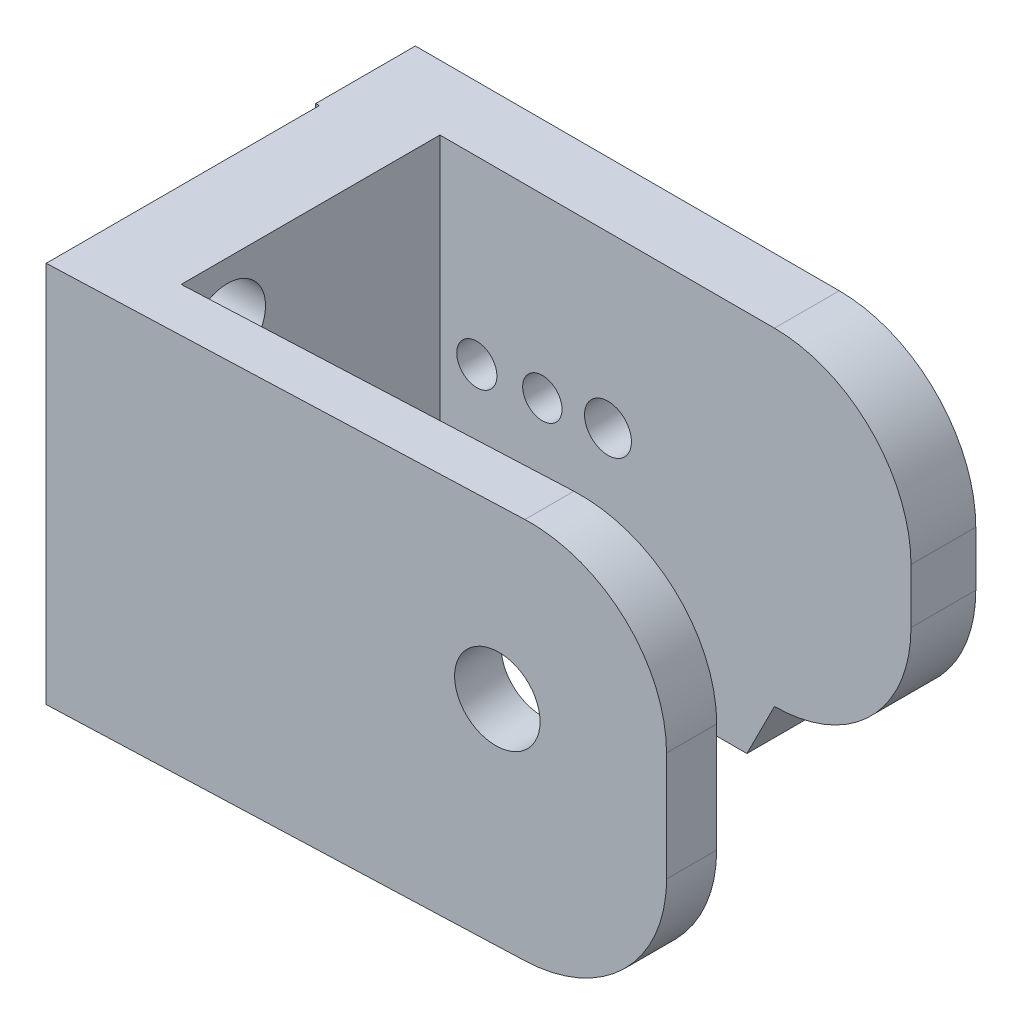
from build123d import *

# Parameters (mm, degrees)
BOSS_EXTRUDE1_DEPTH      = 10
BOSS_EXTRUDE1_DEPTH_BACK = 2
SKETCH1_W                = 20.528750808
SKETCH1_H                = 3.649692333
CUT_EXTRUDE1_DEPTH       = 1
SKETCH3_R                = 0.735889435
SKETCH3_R_2              = 0.720970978
SKETCH3_R_3              = 0.858730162
CUT_EXTRUDE2_DEPTH       = 6
SKETCH4_W                = 17.738010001
SKETCH4_H                = 2.561945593
CUT_EXTRUDE3_DEPTH       = 18
BOSS_EXTRUDE2_DEPTH      = 14
SKETCH6_R                = 1.4
CUT_EXTRUDE4_DEPTH       = 12
SKETCH7_R                = 1.509479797
CUT_EXTRUDE5_DEPTH       = 9
FILLET2_R                = 5
BOSS_EXTRUDE3_DEPTH      = 2.2


with BuildPart() as part:
    # Sketch1 → Boss-Extrude1 (new, two sides: drawn at the far end of the back side and taken through both)
    with BuildSketch(Plane(origin=(0, 0, 0), x_dir=(1, 0, 0), z_dir=(0, 1, 0)).offset(-BOSS_EXTRUDE1_DEPTH_BACK)):
        with Locations((-25.694882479, 1.824846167)):
            Rectangle(SKETCH1_W, SKETCH1_H)
    extrude(amount=BOSS_EXTRUDE1_DEPTH + BOSS_EXTRUDE1_DEPTH_BACK)

    # Sketch2 → Cut-Extrude1 (cut)
    with BuildSketch(Plane(origin=(0, 0, -3.649692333), x_dir=(-1, 0, 0), z_dir=(0, 0, -1))):
        with BuildLine():
            Line((21.244501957, 8.174566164), (37.728305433, 5.808729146))
            Line((37.728305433, 5.808729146), (37.728305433, 0.613467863))
            Line((37.728305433, 0.613467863), (20.68802272, 0.380375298))
            ThreePointArc((20.68802272, 0.380375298), (16.781007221, 4.57628399), (21.244501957, 8.174566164))
        make_face()
    extrude(amount=-CUT_EXTRUDE1_DEPTH, mode=Mode.SUBTRACT)

    # Sketch3 → Cut-Extrude2 (cut)
    with BuildSketch(Plane(origin=(0, 0, -2.649692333), x_dir=(-1, 0, 0), z_dir=(0, 0, -1))):
        with Locations((31.333723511, 3.39696779)):
            Circle(SKETCH3_R)
        with Locations((28.933932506, 3.531396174)):
            Circle(SKETCH3_R_2)
        with Locations((26.528787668, 3.775580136)):
            Circle(SKETCH3_R_3)
    extrude(amount=-CUT_EXTRUDE2_DEPTH, mode=Mode.SUBTRACT)

    # Sketch4 → Cut-Extrude3 (cut)
    with BuildSketch(Plane(origin=(0, 10, 0), x_dir=(1, 0, 0), z_dir=(0, 1, 0))):
        with Locations((-23.848967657, -0.005735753)):
            Rectangle(SKETCH4_W, SKETCH4_H)
    extrude(amount=-CUT_EXTRUDE3_DEPTH, mode=Mode.SUBTRACT)

    # Sketch5 → Boss-Extrude2 (add)
    with BuildSketch(Plane(origin=(0, 10, 0), x_dir=(1, 0, 0), z_dir=(0, 1, 0))):
        Polygon((-32.686094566, -3.679970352), (-32.686094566, -8.202804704), (-13.931538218, -7.341101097), (-13.931538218, -9.177984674), (-35.828035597, -10.004240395), (-35.828035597, -3.679970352), (-35.828035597, 1.275237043), (-32.686094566, 1.275237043), align=None)
    extrude(amount=-BOSS_EXTRUDE2_DEPTH)

    # Sketch6 → Cut-Extrude4 (cut)
    with BuildSketch(Plane(origin=(-32.686094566, 0, 0), x_dir=(0, 0, -1), z_dir=(1, 0, 0))):
        with Locations((-6.513094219, 7.783525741)):
            Circle(SKETCH6_R)
        with Locations((-0.513029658, 0.138347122)):
            Circle(SKETCH6_R)
    extrude(amount=-CUT_EXTRUDE4_DEPTH, mode=Mode.SUBTRACT)

    # Sketch7 → Cut-Extrude5 (cut)
    with BuildSketch(Plane(origin=(0.32602629, 0, 8.639981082), x_dir=(0.9992888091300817, 0, -0.03770777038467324), z_dir=(0.03770777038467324, 0, 0.9992888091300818))):
        with Locations((-20.244260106, 3.840550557)):
            Circle(SKETCH7_R)
    extrude(amount=-CUT_EXTRUDE5_DEPTH, mode=Mode.SUBTRACT)

    # Fillet2
    fillet2_edges = [part.edges().sort_by_distance(p)[0] for p in [
        (-15.430507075, 10, -2.462464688),
        (-15.430507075, -2, -2.462464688),
        (-13.931538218, -4, 8.259542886),
        (-13.931538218, 10, 8.259542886),
    ]]
    fillet(fillet2_edges, radius=FILLET2_R)

    # Sketch8 → Boss-Extrude3 (add)
    with BuildSketch(Plane(origin=(0, 0, -1.275237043), x_dir=(-1, 0, 0), z_dir=(0, 0, -1))):
        Polygon((35.828035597, -4), (21.4404238, -4), (20.430507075, -2), (35.959257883, -1.178424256), (35.828035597, -2), align=None)
    extrude(amount=BOSS_EXTRUDE3_DEPTH)


solid = part.part
